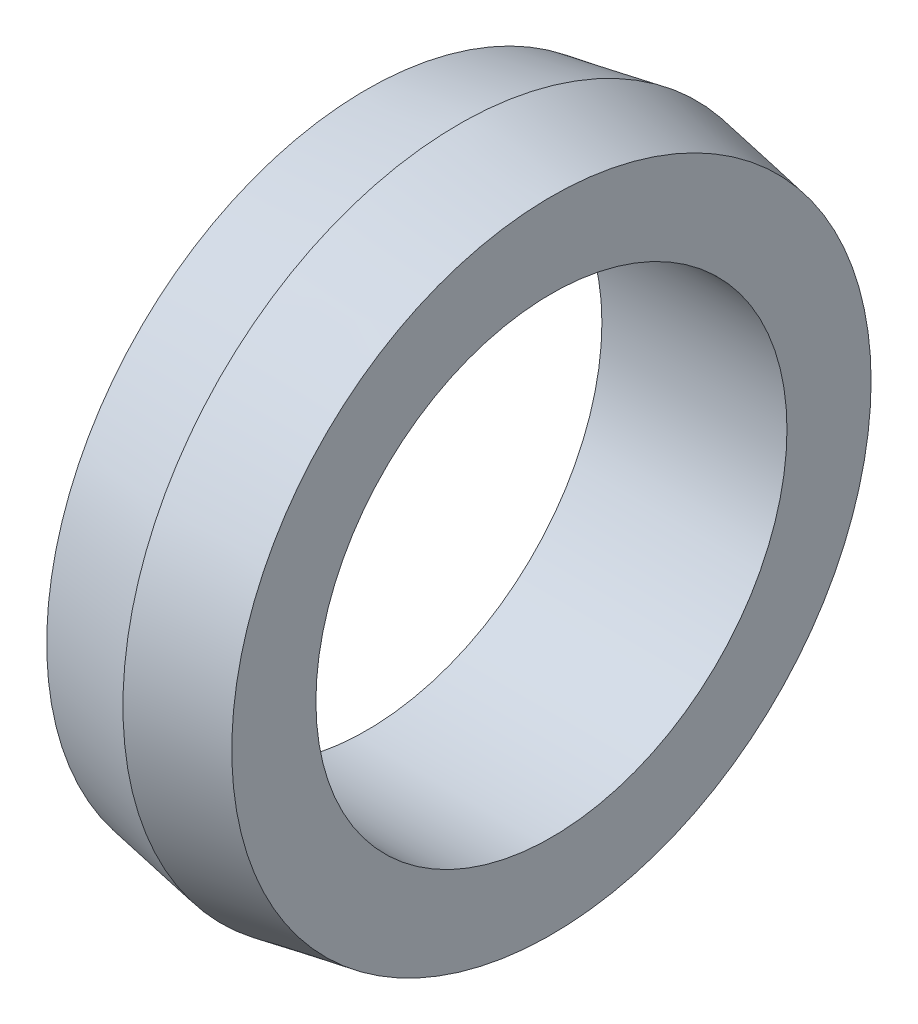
from build123d import *


with BuildPart() as part:
    # Sketch1 → Revolve1 (revolve)
    with BuildSketch(Plane.XY, mode=Mode.PRIVATE) as revolve1_sk:
        Polygon((-16.5, 42), (16.5, 42), (16.5, 57), (0, 59.909395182), (-16.5, 57), align=None)
    revolve(revolve1_sk.sketch.rotate(Axis((0, 0, 0), (-1, 0, 0)), 90), axis=Axis((0, 0, 0), (-1, 0, 0)))


solid = part.part
